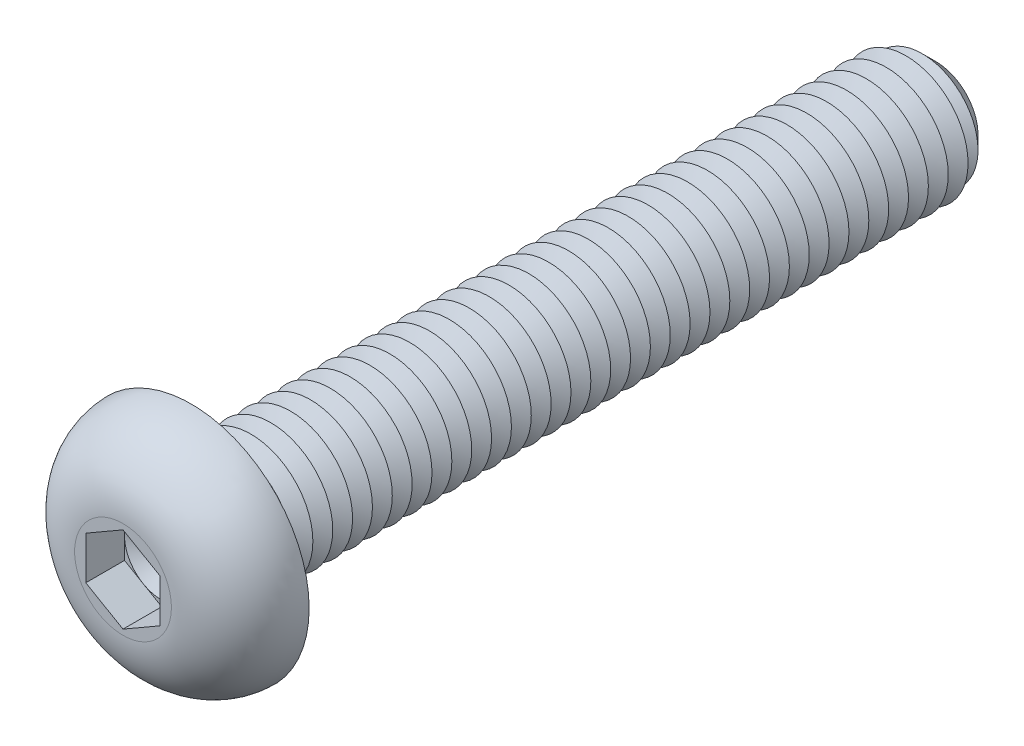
from build123d import *

# Parameters (mm, degrees)
CUT_EXTRUDE1_DEPTH  = 1.56
SKETCH4_R           = 2.5
BOSS_EXTRUDE1_DEPTH = 30
CHAMFER1_SIZE       = 0.8
LPATTERN1_COUNT     = 36
LPATTERN1_PITCH     = 0.8
FILLET2_R           = 0.4


with BuildPart() as part:
    # Sketch2 → Revolve1 (revolve)
    with BuildSketch(Plane(origin=(0, 0, 0), x_dir=(0, 0, -1), z_dir=(1, 0, 0)), mode=Mode.PRIVATE) as revolve1_sk:
        with BuildLine():
            Line((0, 0), (-2.75, 0))
            Line((-2.75, 0), (-2.75, 1.950446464))
            ThreePointArc((-2.75, 1.950446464), (-1.947498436, 3.912588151), (0, 4.75))
            Line((0, 4.75), (0, 0))
        make_face()
    revolve(revolve1_sk.sketch.rotate(Axis((0, 0, 47.934239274), (0, 0, -1)), 90), axis=Axis((0, 0, 47.934239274), (0, 0, -1)))

    # Sketch3 → Cut-Extrude1 (cut)
    with BuildSketch(Plane.XY.offset(2.75)):
        Polygon((0, 1.732050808), (-1.5, 0.866025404), (-1.5, -0.866025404), (0, -1.732050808), (1.5, -0.866025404), (1.5, 0.866025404), align=None)
    extrude(amount=-CUT_EXTRUDE1_DEPTH, mode=Mode.SUBTRACT)

    # Sketch4 → Boss-Extrude1 (add)
    with BuildSketch(Plane(origin=(0, 0, 0), x_dir=(-1, 0, 0), z_dir=(0, 0, -1))):
        with Locations(Location((0, 0, 0), (0, 0, 180))):
            Circle(SKETCH4_R)
    extrude(amount=BOSS_EXTRUDE1_DEPTH)

    # Chamfer1
    chamfer1_edges = [part.edges().sort_by_distance(p)[0] for p in [
        (-2.5, 0, -30),
    ]]
    chamfer(chamfer1_edges, length=CHAMFER1_SIZE)

    # Sketch5 → Cut-Revolve1 (revolve, cut)
    with BuildSketch(Plane(origin=(0, 0, 0), x_dir=(0, 0, -1), z_dir=(1, 0, 0)), mode=Mode.PRIVATE) as cut_revolve1_sk:
        Polygon((0.8, 2.5), (1.6, 2.5), (1.2, 1.807179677), align=None)
    cut_revolve1 = revolve(cut_revolve1_sk.sketch.rotate(Axis((0, 0, 47.934239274), (0, 0, -1)), 90), axis=Axis((0, 0, 47.934239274), (0, 0, -1)), mode=Mode.SUBTRACT)

    # LPattern1: Cut-Revolve1 ×36
    with Locations(*[(0, 0, -i * LPATTERN1_PITCH) for i in range(1, LPATTERN1_COUNT)]):
        add(cut_revolve1, mode=Mode.SUBTRACT)

    # Fillet2
    fillet2_edges = [part.edges().sort_by_distance(p)[0] for p in [
        (-2.5, 0, 0),
    ]]
    fillet(fillet2_edges, radius=FILLET2_R)

    # Cut-Extrude2 cone 1 section (on through the dimple's axis) → Cut-Extrude2 (revolve, cut)
    with BuildSketch(Plane(origin=(0, 0, 1.19), x_dir=(0, -1, 0), z_dir=(1, 0, 0))):
        Polygon((0, 0), (1.5, 0), (0, 0.866025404), align=None)
    revolve(axis=Axis((0, 0, 1.19), (0, 0, -1)), mode=Mode.SUBTRACT)


solid = part.part
